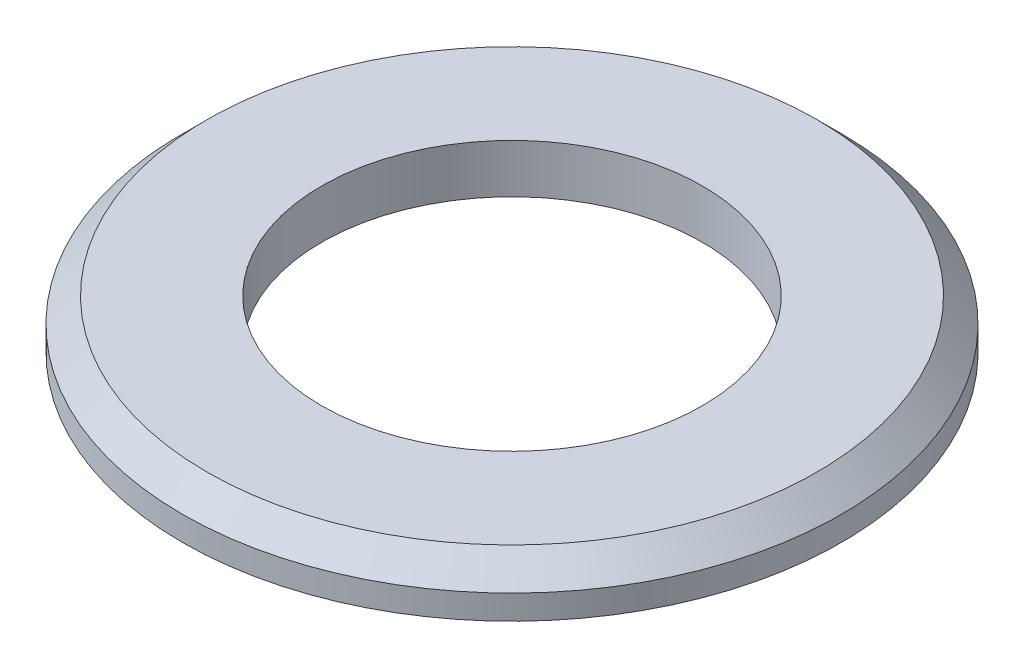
ISO-10303-21;
HEADER;
FILE_DESCRIPTION(('STEP AP214'),'2;1');
FILE_NAME('part.step','',(''),(''),'','','');
FILE_SCHEMA(('AUTOMOTIVE_DESIGN { 1 0 10303 214 1 1 1 1 }'));
ENDSEC;
DATA;
#1=APPLICATION_CONTEXT('core data for automotive mechanical design processes');
#2=APPLICATION_PROTOCOL_DEFINITION('international standard','automotive_design',2000,#1);
#3=PRODUCT_CONTEXT('',#1,'mechanical');
#4=PRODUCT('Part','Part','',(#3));
#5=PRODUCT_RELATED_PRODUCT_CATEGORY('part','',(#4));
#6=PRODUCT_DEFINITION_FORMATION('','',#4);
#7=PRODUCT_DEFINITION_CONTEXT('part definition',#1,'design');
#8=PRODUCT_DEFINITION('design','',#6,#7);
#9=PRODUCT_DEFINITION_SHAPE('','',#8);
#10=(LENGTH_UNIT() NAMED_UNIT(*) SI_UNIT(.MILLI.,.METRE.));
#11=(NAMED_UNIT(*) PLANE_ANGLE_UNIT() SI_UNIT($,.RADIAN.));
#12=(NAMED_UNIT(*) SI_UNIT($,.STERADIAN.) SOLID_ANGLE_UNIT());
#13=UNCERTAINTY_MEASURE_WITH_UNIT(LENGTH_MEASURE(1.E-05),#10,'distance_accuracy_value','');
#14=(GEOMETRIC_REPRESENTATION_CONTEXT(3) GLOBAL_UNCERTAINTY_ASSIGNED_CONTEXT((#13)) GLOBAL_UNIT_ASSIGNED_CONTEXT((#10,
#11,#12)) REPRESENTATION_CONTEXT('',''));
#15=CARTESIAN_POINT('',(0.,0.,0.));
#16=DIRECTION('',(0.,0.,1.));
#17=DIRECTION('',(1.,0.,0.));
#18=AXIS2_PLACEMENT_3D('',#15,#16,#17);
#19=CARTESIAN_POINT('',(0.,10.,0.));
#20=DIRECTION('',(0.,1.,0.));
#21=DIRECTION('',(0.,0.,1.));
#22=AXIS2_PLACEMENT_3D('',#19,#20,#21);
#23=PLANE('',#22);
#24=CARTESIAN_POINT('',(0.,10.,0.));
#25=DIRECTION('',(0.,1.,0.));
#26=DIRECTION('',(0.,0.,1.));
#27=AXIS2_PLACEMENT_3D('',#24,#25,#26);
#28=CIRCLE('',#27,62.5);
#29=CARTESIAN_POINT('',(0.,10.,62.5));
#30=VERTEX_POINT('',#29);
#31=EDGE_CURVE('E35',#30,#30,#28,.T.);
#32=ORIENTED_EDGE('',*,*,#31,.T.);
#33=EDGE_LOOP('',(#32));
#34=FACE_BOUND('',#33,.T.);
#35=CARTESIAN_POINT('',(0.,10.,0.));
#36=DIRECTION('',(0.,1.,0.));
#37=DIRECTION('',(0.,0.,1.));
#38=AXIS2_PLACEMENT_3D('',#35,#36,#37);
#39=CIRCLE('',#38,39.);
#40=CARTESIAN_POINT('',(0.,10.,39.));
#41=VERTEX_POINT('',#40);
#42=EDGE_CURVE('E43',#41,#41,#39,.T.);
#43=ORIENTED_EDGE('',*,*,#42,.F.);
#44=EDGE_LOOP('',(#43));
#45=FACE_BOUND('',#44,.T.);
#46=ADVANCED_FACE('F28',(#34,#45),#23,.T.);
#47=CARTESIAN_POINT('',(0.,0.,0.));
#48=DIRECTION('',(0.,1.,0.));
#49=DIRECTION('',(0.,0.,1.));
#50=AXIS2_PLACEMENT_3D('',#47,#48,#49);
#51=PLANE('',#50);
#52=CARTESIAN_POINT('',(0.,0.,0.));
#53=DIRECTION('',(0.,1.,0.));
#54=DIRECTION('',(0.,0.,1.));
#55=AXIS2_PLACEMENT_3D('',#52,#53,#54);
#56=CIRCLE('',#55,67.5);
#57=CARTESIAN_POINT('',(0.,0.,67.5));
#58=VERTEX_POINT('',#57);
#59=EDGE_CURVE('E39',#58,#58,#56,.T.);
#60=ORIENTED_EDGE('',*,*,#59,.F.);
#61=EDGE_LOOP('',(#60));
#62=FACE_BOUND('',#61,.T.);
#63=CARTESIAN_POINT('',(0.,0.,0.));
#64=DIRECTION('',(0.,1.,0.));
#65=DIRECTION('',(0.,0.,1.));
#66=AXIS2_PLACEMENT_3D('',#63,#64,#65);
#67=CIRCLE('',#66,39.);
#68=CARTESIAN_POINT('',(0.,0.,39.));
#69=VERTEX_POINT('',#68);
#70=EDGE_CURVE('E48',#69,#69,#67,.T.);
#71=ORIENTED_EDGE('',*,*,#70,.T.);
#72=EDGE_LOOP('',(#71));
#73=FACE_BOUND('',#72,.T.);
#74=ADVANCED_FACE('F52',(#62,#73),#51,.F.);
#75=CARTESIAN_POINT('',(0.,10.,0.));
#76=DIRECTION('',(0.,-1.,0.));
#77=DIRECTION('',(0.,0.,-1.));
#78=AXIS2_PLACEMENT_3D('',#75,#76,#77);
#79=CYLINDRICAL_SURFACE('',#78,67.5);
#80=CARTESIAN_POINT('',(0.,5.,0.));
#81=DIRECTION('',(0.,1.,0.));
#82=DIRECTION('',(0.,0.,1.));
#83=AXIS2_PLACEMENT_3D('',#80,#81,#82);
#84=CIRCLE('',#83,67.5);
#85=CARTESIAN_POINT('',(0.,5.,67.5));
#86=VERTEX_POINT('',#85);
#87=EDGE_CURVE('E10',#86,#86,#84,.F.);
#88=ORIENTED_EDGE('',*,*,#87,.T.);
#89=EDGE_LOOP('',(#88));
#90=FACE_BOUND('',#89,.T.);
#91=ORIENTED_EDGE('',*,*,#59,.T.);
#92=EDGE_LOOP('',(#91));
#93=FACE_BOUND('',#92,.T.);
#94=ADVANCED_FACE('F30',(#90,#93),#79,.T.);
#95=CARTESIAN_POINT('',(0.,10.,0.));
#96=DIRECTION('',(0.,-1.,0.));
#97=DIRECTION('',(0.,0.,-1.));
#98=AXIS2_PLACEMENT_3D('',#95,#96,#97);
#99=CYLINDRICAL_SURFACE('',#98,39.);
#100=ORIENTED_EDGE('',*,*,#42,.T.);
#101=EDGE_LOOP('',(#100));
#102=FACE_BOUND('',#101,.T.);
#103=ORIENTED_EDGE('',*,*,#70,.F.);
#104=EDGE_LOOP('',(#103));
#105=FACE_BOUND('',#104,.T.);
#106=ADVANCED_FACE('F54',(#102,#105),#99,.F.);
#107=CARTESIAN_POINT('',(0.,10.,0.));
#108=DIRECTION('',(0.,-1.,0.));
#109=DIRECTION('',(0.,0.,-1.));
#110=AXIS2_PLACEMENT_3D('',#107,#108,#109);
#111=CONICAL_SURFACE('',#110,62.5,0.785398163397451);
#112=ORIENTED_EDGE('',*,*,#87,.F.);
#113=EDGE_LOOP('',(#112));
#114=FACE_BOUND('',#113,.T.);
#115=ORIENTED_EDGE('',*,*,#31,.F.);
#116=EDGE_LOOP('',(#115));
#117=FACE_BOUND('',#116,.T.);
#118=ADVANCED_FACE('F56',(#114,#117),#111,.T.);
#119=CLOSED_SHELL('',(#46,#74,#94,#106,#118));
#120=MANIFOLD_SOLID_BREP('B2',#119);
#121=ADVANCED_BREP_SHAPE_REPRESENTATION('',(#18,#120),#14);
#122=SHAPE_DEFINITION_REPRESENTATION(#9,#121);
ENDSEC;
END-ISO-10303-21;
